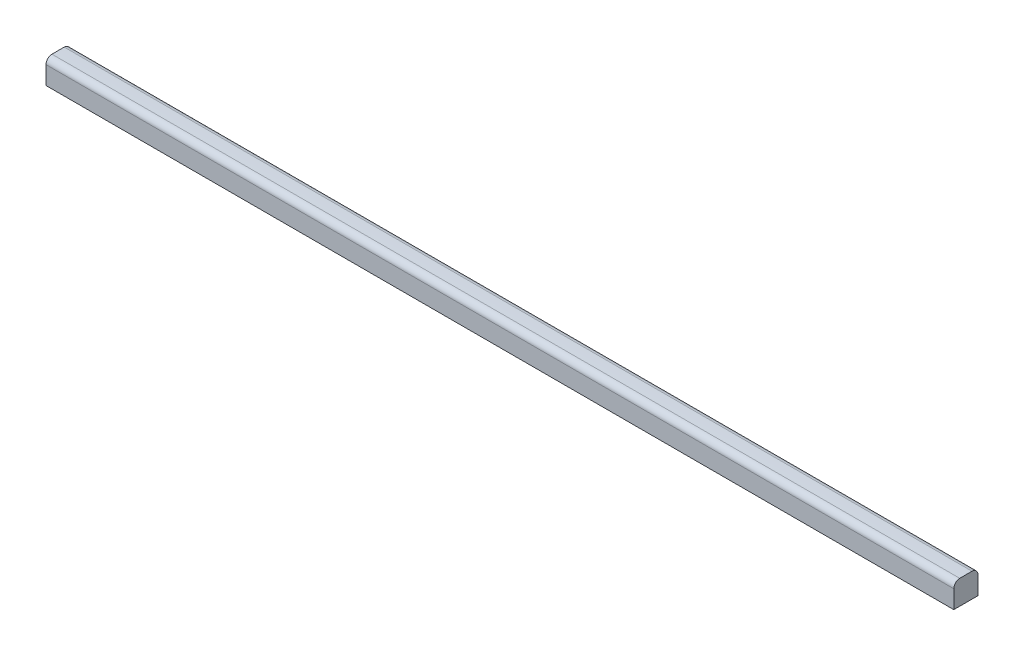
ISO-10303-21;
HEADER;
FILE_DESCRIPTION(('STEP AP214'),'2;1');
FILE_NAME('part.step','',(''),(''),'','','');
FILE_SCHEMA(('AUTOMOTIVE_DESIGN { 1 0 10303 214 1 1 1 1 }'));
ENDSEC;
DATA;
#1=APPLICATION_CONTEXT('core data for automotive mechanical design processes');
#2=APPLICATION_PROTOCOL_DEFINITION('international standard','automotive_design',2000,#1);
#3=PRODUCT_CONTEXT('',#1,'mechanical');
#4=PRODUCT('Part','Part','',(#3));
#5=PRODUCT_RELATED_PRODUCT_CATEGORY('part','',(#4));
#6=PRODUCT_DEFINITION_FORMATION('','',#4);
#7=PRODUCT_DEFINITION_CONTEXT('part definition',#1,'design');
#8=PRODUCT_DEFINITION('design','',#6,#7);
#9=PRODUCT_DEFINITION_SHAPE('','',#8);
#10=(LENGTH_UNIT() NAMED_UNIT(*) SI_UNIT(.MILLI.,.METRE.));
#11=(NAMED_UNIT(*) PLANE_ANGLE_UNIT() SI_UNIT($,.RADIAN.));
#12=(NAMED_UNIT(*) SI_UNIT($,.STERADIAN.) SOLID_ANGLE_UNIT());
#13=UNCERTAINTY_MEASURE_WITH_UNIT(LENGTH_MEASURE(1.E-05),#10,'distance_accuracy_value','');
#14=(GEOMETRIC_REPRESENTATION_CONTEXT(3) GLOBAL_UNCERTAINTY_ASSIGNED_CONTEXT((#13)) GLOBAL_UNIT_ASSIGNED_CONTEXT((#10,
#11,#12)) REPRESENTATION_CONTEXT('',''));
#15=CARTESIAN_POINT('',(0.,0.,0.));
#16=DIRECTION('',(0.,0.,1.));
#17=DIRECTION('',(1.,0.,0.));
#18=AXIS2_PLACEMENT_3D('',#15,#16,#17);
#19=CARTESIAN_POINT('',(150.,71.,2.));
#20=DIRECTION('',(0.,1.,0.));
#21=DIRECTION('',(0.,0.,1.));
#22=AXIS2_PLACEMENT_3D('',#19,#20,#21);
#23=PLANE('',#22);
#24=DIRECTION('',(0.,0.,-1.));
#25=VECTOR('',#24,1.);
#26=CARTESIAN_POINT('',(0.,71.,2.));
#27=LINE('',#26,#25);
#28=CARTESIAN_POINT('',(0.,71.,2.));
#29=VERTEX_POINT('',#28);
#30=CARTESIAN_POINT('',(0.,71.,-2.));
#31=VERTEX_POINT('',#30);
#32=EDGE_CURVE('E107',#29,#31,#27,.T.);
#33=ORIENTED_EDGE('',*,*,#32,.T.);
#34=DIRECTION('',(-1.,0.,0.));
#35=VECTOR('',#34,1.);
#36=CARTESIAN_POINT('',(150.,71.,-2.));
#37=LINE('',#36,#35);
#38=CARTESIAN_POINT('',(150.,71.,-2.));
#39=VERTEX_POINT('',#38);
#40=EDGE_CURVE('E92',#39,#31,#37,.T.);
#41=ORIENTED_EDGE('',*,*,#40,.F.);
#42=DIRECTION('',(0.,0.,-1.));
#43=VECTOR('',#42,1.);
#44=CARTESIAN_POINT('',(150.,71.,2.));
#45=LINE('',#44,#43);
#46=CARTESIAN_POINT('',(150.,71.,2.));
#47=VERTEX_POINT('',#46);
#48=EDGE_CURVE('E96',#47,#39,#45,.T.);
#49=ORIENTED_EDGE('',*,*,#48,.F.);
#50=DIRECTION('',(-1.,0.,0.));
#51=VECTOR('',#50,1.);
#52=CARTESIAN_POINT('',(150.,71.,2.));
#53=LINE('',#52,#51);
#54=EDGE_CURVE('E109',#47,#29,#53,.T.);
#55=ORIENTED_EDGE('',*,*,#54,.T.);
#56=EDGE_LOOP('',(#33,#41,#49,#55));
#57=FACE_BOUND('',#56,.T.);
#58=ADVANCED_FACE('F35',(#57),#23,.F.);
#59=CARTESIAN_POINT('',(150.,71.,-2.));
#60=DIRECTION('',(0.,0.,1.));
#61=DIRECTION('',(1.,0.,0.));
#62=AXIS2_PLACEMENT_3D('',#59,#60,#61);
#63=PLANE('',#62);
#64=DIRECTION('',(0.,1.,0.));
#65=VECTOR('',#64,1.);
#66=CARTESIAN_POINT('',(0.,71.,-2.));
#67=LINE('',#66,#65);
#68=CARTESIAN_POINT('',(0.,73.9932429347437,-2.));
#69=VERTEX_POINT('',#68);
#70=EDGE_CURVE('E135',#31,#69,#67,.T.);
#71=ORIENTED_EDGE('',*,*,#70,.T.);
#72=DIRECTION('',(-1.,0.,0.));
#73=VECTOR('',#72,1.);
#74=CARTESIAN_POINT('',(150.,73.9932429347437,-2.));
#75=LINE('',#74,#73);
#76=CARTESIAN_POINT('',(150.,73.9932429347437,-2.));
#77=VERTEX_POINT('',#76);
#78=EDGE_CURVE('E58',#69,#77,#75,.F.);
#79=ORIENTED_EDGE('',*,*,#78,.T.);
#80=DIRECTION('',(0.,1.,0.));
#81=VECTOR('',#80,1.);
#82=CARTESIAN_POINT('',(150.,71.,-2.));
#83=LINE('',#82,#81);
#84=EDGE_CURVE('E88',#39,#77,#83,.T.);
#85=ORIENTED_EDGE('',*,*,#84,.F.);
#86=ORIENTED_EDGE('',*,*,#40,.T.);
#87=EDGE_LOOP('',(#71,#79,#85,#86));
#88=FACE_BOUND('',#87,.T.);
#89=ADVANCED_FACE('F90',(#88),#63,.F.);
#90=CARTESIAN_POINT('',(150.,0.,0.));
#91=DIRECTION('',(-1.,0.,0.));
#92=DIRECTION('',(0.,0.,1.));
#93=AXIS2_PLACEMENT_3D('',#90,#91,#92);
#94=CYLINDRICAL_SURFACE('',#93,75.);
#95=CARTESIAN_POINT('',(150.,0.,0.));
#96=DIRECTION('',(1.,0.,0.));
#97=DIRECTION('',(0.,0.,-1.));
#98=AXIS2_PLACEMENT_3D('',#95,#96,#97);
#99=CIRCLE('',#98,75.);
#100=CARTESIAN_POINT('',(150.,74.9931516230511,-1.01351351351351));
#101=VERTEX_POINT('',#100);
#102=CARTESIAN_POINT('',(150.,74.9931516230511,1.01351351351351));
#103=VERTEX_POINT('',#102);
#104=EDGE_CURVE('E95',#101,#103,#99,.T.);
#105=ORIENTED_EDGE('',*,*,#104,.F.);
#106=DIRECTION('',(-1.,0.,0.));
#107=VECTOR('',#106,1.);
#108=CARTESIAN_POINT('',(150.,74.9931516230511,-1.01351351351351));
#109=LINE('',#108,#107);
#110=CARTESIAN_POINT('',(0.,74.9931516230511,-1.01351351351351));
#111=VERTEX_POINT('',#110);
#112=EDGE_CURVE('E111',#101,#111,#109,.T.);
#113=ORIENTED_EDGE('',*,*,#112,.T.);
#114=CARTESIAN_POINT('',(0.,0.,0.));
#115=DIRECTION('',(1.,0.,0.));
#116=DIRECTION('',(0.,0.,-1.));
#117=AXIS2_PLACEMENT_3D('',#114,#115,#116);
#118=CIRCLE('',#117,75.);
#119=CARTESIAN_POINT('',(0.,74.9931516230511,1.01351351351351));
#120=VERTEX_POINT('',#119);
#121=EDGE_CURVE('E136',#111,#120,#118,.T.);
#122=ORIENTED_EDGE('',*,*,#121,.T.);
#123=DIRECTION('',(-1.,0.,0.));
#124=VECTOR('',#123,1.);
#125=CARTESIAN_POINT('',(150.,74.9931516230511,1.01351351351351));
#126=LINE('',#125,#124);
#127=EDGE_CURVE('E108',#120,#103,#126,.F.);
#128=ORIENTED_EDGE('',*,*,#127,.T.);
#129=EDGE_LOOP('',(#105,#113,#122,#128));
#130=FACE_BOUND('',#129,.T.);
#131=ADVANCED_FACE('F127',(#130),#94,.T.);
#132=CARTESIAN_POINT('',(150.,71.,2.));
#133=DIRECTION('',(0.,0.,-1.));
#134=DIRECTION('',(-1.,0.,0.));
#135=AXIS2_PLACEMENT_3D('',#132,#133,#134);
#136=PLANE('',#135);
#137=DIRECTION('',(0.,-1.,0.));
#138=VECTOR('',#137,1.);
#139=CARTESIAN_POINT('',(150.,71.,2.));
#140=LINE('',#139,#138);
#141=CARTESIAN_POINT('',(150.,73.9932429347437,2.));
#142=VERTEX_POINT('',#141);
#143=EDGE_CURVE('E100',#142,#47,#140,.T.);
#144=ORIENTED_EDGE('',*,*,#143,.F.);
#145=DIRECTION('',(-1.,0.,0.));
#146=VECTOR('',#145,1.);
#147=CARTESIAN_POINT('',(150.,73.9932429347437,2.));
#148=LINE('',#147,#146);
#149=CARTESIAN_POINT('',(0.,73.9932429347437,2.));
#150=VERTEX_POINT('',#149);
#151=EDGE_CURVE('E11',#142,#150,#148,.T.);
#152=ORIENTED_EDGE('',*,*,#151,.T.);
#153=DIRECTION('',(0.,-1.,0.));
#154=VECTOR('',#153,1.);
#155=CARTESIAN_POINT('',(0.,71.,2.));
#156=LINE('',#155,#154);
#157=EDGE_CURVE('E104',#150,#29,#156,.T.);
#158=ORIENTED_EDGE('',*,*,#157,.T.);
#159=ORIENTED_EDGE('',*,*,#54,.F.);
#160=EDGE_LOOP('',(#144,#152,#158,#159));
#161=FACE_BOUND('',#160,.T.);
#162=ADVANCED_FACE('F143',(#161),#136,.F.);
#163=CARTESIAN_POINT('',(150.,0.,0.));
#164=DIRECTION('',(1.,0.,0.));
#165=DIRECTION('',(0.,0.,-1.));
#166=AXIS2_PLACEMENT_3D('',#163,#164,#165);
#167=PLANE('',#166);
#168=ORIENTED_EDGE('',*,*,#84,.T.);
#169=CARTESIAN_POINT('',(150.,73.9932429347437,-1.));
#170=DIRECTION('',(1.,0.,0.));
#171=DIRECTION('',(0.,0.,-1.));
#172=AXIS2_PLACEMENT_3D('',#169,#170,#171);
#173=CIRCLE('',#172,1.);
#174=EDGE_CURVE('E43',#77,#101,#173,.T.);
#175=ORIENTED_EDGE('',*,*,#174,.T.);
#176=ORIENTED_EDGE('',*,*,#104,.T.);
#177=CARTESIAN_POINT('',(150.,73.9932429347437,1.));
#178=DIRECTION('',(1.,0.,0.));
#179=DIRECTION('',(0.,0.,-1.));
#180=AXIS2_PLACEMENT_3D('',#177,#178,#179);
#181=CIRCLE('',#180,1.);
#182=EDGE_CURVE('E50',#103,#142,#181,.T.);
#183=ORIENTED_EDGE('',*,*,#182,.T.);
#184=ORIENTED_EDGE('',*,*,#143,.T.);
#185=ORIENTED_EDGE('',*,*,#48,.T.);
#186=EDGE_LOOP('',(#168,#175,#176,#183,#184,#185));
#187=FACE_BOUND('',#186,.T.);
#188=ADVANCED_FACE('F99',(#187),#167,.T.);
#189=CARTESIAN_POINT('',(0.,0.,0.));
#190=DIRECTION('',(1.,0.,0.));
#191=DIRECTION('',(0.,0.,-1.));
#192=AXIS2_PLACEMENT_3D('',#189,#190,#191);
#193=PLANE('',#192);
#194=ORIENTED_EDGE('',*,*,#121,.F.);
#195=CARTESIAN_POINT('',(0.,73.9932429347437,-1.));
#196=DIRECTION('',(1.,0.,0.));
#197=DIRECTION('',(0.,0.,-1.));
#198=AXIS2_PLACEMENT_3D('',#195,#196,#197);
#199=CIRCLE('',#198,1.);
#200=EDGE_CURVE('E120',#111,#69,#199,.F.);
#201=ORIENTED_EDGE('',*,*,#200,.T.);
#202=ORIENTED_EDGE('',*,*,#70,.F.);
#203=ORIENTED_EDGE('',*,*,#32,.F.);
#204=ORIENTED_EDGE('',*,*,#157,.F.);
#205=CARTESIAN_POINT('',(0.,73.9932429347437,1.));
#206=DIRECTION('',(1.,0.,0.));
#207=DIRECTION('',(0.,0.,-1.));
#208=AXIS2_PLACEMENT_3D('',#205,#206,#207);
#209=CIRCLE('',#208,1.);
#210=EDGE_CURVE('E118',#150,#120,#209,.F.);
#211=ORIENTED_EDGE('',*,*,#210,.T.);
#212=EDGE_LOOP('',(#194,#201,#202,#203,#204,#211));
#213=FACE_BOUND('',#212,.T.);
#214=ADVANCED_FACE('F134',(#213),#193,.F.);
#215=CARTESIAN_POINT('',(150.,73.9932429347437,-1.));
#216=DIRECTION('',(-1.,0.,0.));
#217=DIRECTION('',(0.,0.,1.));
#218=AXIS2_PLACEMENT_3D('',#215,#216,#217);
#219=CYLINDRICAL_SURFACE('',#218,1.);
#220=ORIENTED_EDGE('',*,*,#174,.F.);
#221=ORIENTED_EDGE('',*,*,#78,.F.);
#222=ORIENTED_EDGE('',*,*,#200,.F.);
#223=ORIENTED_EDGE('',*,*,#112,.F.);
#224=EDGE_LOOP('',(#220,#221,#222,#223));
#225=FACE_BOUND('',#224,.T.);
#226=ADVANCED_FACE('F132',(#225),#219,.T.);
#227=CARTESIAN_POINT('',(150.,73.9932429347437,1.));
#228=DIRECTION('',(-1.,0.,0.));
#229=DIRECTION('',(0.,0.,1.));
#230=AXIS2_PLACEMENT_3D('',#227,#228,#229);
#231=CYLINDRICAL_SURFACE('',#230,1.);
#232=ORIENTED_EDGE('',*,*,#182,.F.);
#233=ORIENTED_EDGE('',*,*,#127,.F.);
#234=ORIENTED_EDGE('',*,*,#210,.F.);
#235=ORIENTED_EDGE('',*,*,#151,.F.);
#236=EDGE_LOOP('',(#232,#233,#234,#235));
#237=FACE_BOUND('',#236,.T.);
#238=ADVANCED_FACE('F37',(#237),#231,.T.);
#239=CLOSED_SHELL('',(#58,#89,#131,#162,#188,#214,#226,#238));
#240=MANIFOLD_SOLID_BREP('B2',#239);
#241=ADVANCED_BREP_SHAPE_REPRESENTATION('',(#18,#240),#14);
#242=SHAPE_DEFINITION_REPRESENTATION(#9,#241);
ENDSEC;
END-ISO-10303-21;
